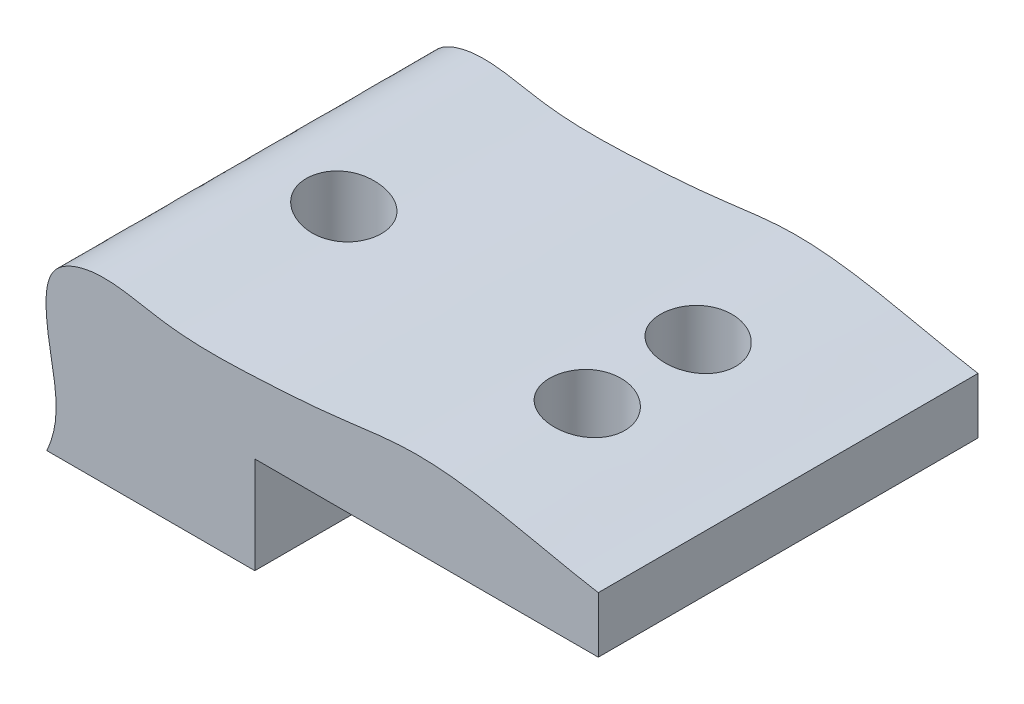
from build123d import *

# Parameters (mm, degrees)
BOSS_EXTRU_1_DEPTH      = 100
BOSS_EXTRU_1_DEPTH_BACK = 102
ESQUISSE2_R             = 20
ENL_V_MAT_EXTRU_1_DEPTH = 333.563807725
ESQUISSE3_R             = 20
ENL_V_MAT_EXTRU_2_DEPTH = 323.358228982
TROU_TARAUD_M101_D      = 8.5
TROU_TARAUD_M101_DEPTH  = 30
TROU_TARAUD_M101_TIP    = 2.553657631
TROU_TARAUD_M102_D      = 8.5
TROU_TARAUD_M102_DEPTH  = 25
TROU_TARAUD_M102_TIP    = 2.553657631


with BuildPart() as part:
    # Esquisse1 → Boss.-Extru.1 (new, two sides: drawn at the far end of the back side and taken through both)
    with BuildSketch(Plane.XY.offset(-BOSS_EXTRU_1_DEPTH_BACK)):
        with BuildLine():
            Line((-301.080515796, 81.5), (-190.335228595, 81.5))
            Line((-190.335228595, 81.5), (-190.335228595, 133))
            Line((-190.335228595, 133), (-7.621916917, 133))
            Line((-7.621916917, 133), (-7.621916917, 162.755280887))
            add(Edge.make_bspline(
                [(-301.080515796, 81.5), (-290.551932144, 103.671702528), (-302.938840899, 128.156812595), (-301.113613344, 167.556907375), (-273.22268262, 180.056314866), (-237.483766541, 169.22526904), (-192.067648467, 170.426961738), (-148.487157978, 173.311000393), (-87.445218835, 183.088140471), (-40.729834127, 168.328576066), (-7.621916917, 162.755280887)],
                knots=[0, 0, 0, 0, 0.165588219, 0.228412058, 0.27301841, 0.383064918, 0.514092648, 0.630987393, 0.728953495, 1, 1, 1, 1], degree=3))
        make_face()
    extrude(amount=BOSS_EXTRU_1_DEPTH + BOSS_EXTRU_1_DEPTH_BACK)

    # Esquisse2 → Enl_v. mat.-Extru.1 (cut, through all)
    with BuildSketch(Plane.XZ.offset(-81.5)):
        with Locations(Location((-243, 0, 0), (0, 0, 270))):
            Circle(ESQUISSE2_R)
    extrude(amount=-ENL_V_MAT_EXTRU_1_DEPTH, mode=Mode.SUBTRACT)

    # Esquisse3 → Enl_v. mat.-Extru.2 (cut, through all)
    with BuildSketch(Plane.XZ.offset(-133)):
        with Locations(Location((-84, 29.5, 0), (0, 0, 270))):
            Circle(ESQUISSE3_R)
        with Locations(Location((-84, -29.5, 0), (0, 0, 270))):
            Circle(ESQUISSE3_R)
    extrude(amount=-ENL_V_MAT_EXTRU_2_DEPTH, mode=Mode.SUBTRACT)

    # Trou taraud_ M101
    with Locations(Plane(origin=(0, 81.5, 0), x_dir=(-1, 0, 0), z_dir=(0, -1, 0))):
        with Locations((217, 50), (269, 50), (269, -50), (217, -50)):
            Hole(TROU_TARAUD_M101_D / 2, depth=TROU_TARAUD_M101_DEPTH)
            with Locations((0, 0, -(TROU_TARAUD_M101_DEPTH + TROU_TARAUD_M101_TIP / 2))):  # 118° drill point
                Cone(0, TROU_TARAUD_M101_D / 2, TROU_TARAUD_M101_TIP, mode=Mode.SUBTRACT)

    # Trou taraud_ M102
    with Locations(Plane(origin=(0, 133, 0), x_dir=(-1, 0, 0), z_dir=(0, -1, 0))):
        with Locations((79, -84.5), (109, -84.5), (59, 84.5), (109, 84.5)):
            Hole(TROU_TARAUD_M102_D / 2, depth=TROU_TARAUD_M102_DEPTH)
            with Locations((0, 0, -(TROU_TARAUD_M102_DEPTH + TROU_TARAUD_M102_TIP / 2))):  # 118° drill point
                Cone(0, TROU_TARAUD_M102_D / 2, TROU_TARAUD_M102_TIP, mode=Mode.SUBTRACT)


solid = part.part
